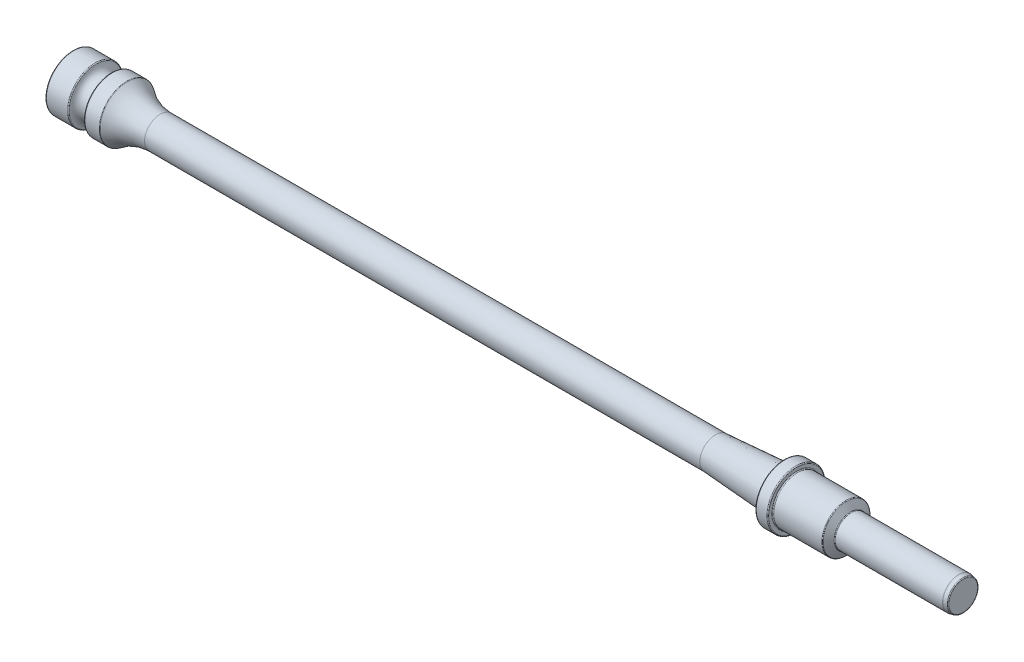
ISO-10303-21;
HEADER;
FILE_DESCRIPTION(('STEP AP214'),'2;1');
FILE_NAME('part.step','',(''),(''),'','','');
FILE_SCHEMA(('AUTOMOTIVE_DESIGN { 1 0 10303 214 1 1 1 1 }'));
ENDSEC;
DATA;
#1=APPLICATION_CONTEXT('core data for automotive mechanical design processes');
#2=APPLICATION_PROTOCOL_DEFINITION('international standard','automotive_design',2000,#1);
#3=PRODUCT_CONTEXT('',#1,'mechanical');
#4=PRODUCT('Part','Part','',(#3));
#5=PRODUCT_RELATED_PRODUCT_CATEGORY('part','',(#4));
#6=PRODUCT_DEFINITION_FORMATION('','',#4);
#7=PRODUCT_DEFINITION_CONTEXT('part definition',#1,'design');
#8=PRODUCT_DEFINITION('design','',#6,#7);
#9=PRODUCT_DEFINITION_SHAPE('','',#8);
#10=(LENGTH_UNIT() NAMED_UNIT(*) SI_UNIT(.MILLI.,.METRE.));
#11=(NAMED_UNIT(*) PLANE_ANGLE_UNIT() SI_UNIT($,.RADIAN.));
#12=(NAMED_UNIT(*) SI_UNIT($,.STERADIAN.) SOLID_ANGLE_UNIT());
#13=UNCERTAINTY_MEASURE_WITH_UNIT(LENGTH_MEASURE(1.E-05),#10,'distance_accuracy_value','');
#14=(GEOMETRIC_REPRESENTATION_CONTEXT(3) GLOBAL_UNCERTAINTY_ASSIGNED_CONTEXT((#13)) GLOBAL_UNIT_ASSIGNED_CONTEXT((#10,
#11,#12)) REPRESENTATION_CONTEXT('',''));
#15=CARTESIAN_POINT('',(0.,0.,0.));
#16=DIRECTION('',(0.,0.,1.));
#17=DIRECTION('',(1.,0.,0.));
#18=AXIS2_PLACEMENT_3D('',#15,#16,#17);
#19=CARTESIAN_POINT('',(0.,0.,0.));
#20=DIRECTION('',(1.,0.,0.));
#21=DIRECTION('',(0.,0.,-1.));
#22=AXIS2_PLACEMENT_3D('',#19,#20,#21);
#23=PLANE('',#22);
#24=CARTESIAN_POINT('',(0.,0.,0.));
#25=DIRECTION('',(-1.,0.,0.));
#26=DIRECTION('',(0.,0.,1.));
#27=AXIS2_PLACEMENT_3D('',#24,#25,#26);
#28=CIRCLE('',#27,5.8);
#29=CARTESIAN_POINT('',(0.,0.,5.8));
#30=VERTEX_POINT('',#29);
#31=EDGE_CURVE('E10',#30,#30,#28,.T.);
#32=ORIENTED_EDGE('',*,*,#31,.T.);
#33=EDGE_LOOP('',(#32));
#34=FACE_BOUND('',#33,.T.);
#35=ADVANCED_FACE('F29',(#34),#23,.F.);
#36=CARTESIAN_POINT('',(0.2,0.,0.));
#37=DIRECTION('',(-1.,0.,0.));
#38=DIRECTION('',(0.,0.,1.));
#39=AXIS2_PLACEMENT_3D('',#36,#37,#38);
#40=TOROIDAL_SURFACE('',#39,5.8,0.2);
#41=ORIENTED_EDGE('',*,*,#31,.F.);
#42=EDGE_LOOP('',(#41));
#43=FACE_BOUND('',#42,.T.);
#44=CARTESIAN_POINT('',(0.200000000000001,0.,0.));
#45=DIRECTION('',(-1.,0.,0.));
#46=DIRECTION('',(0.,0.,1.));
#47=AXIS2_PLACEMENT_3D('',#44,#45,#46);
#48=CIRCLE('',#47,6.);
#49=CARTESIAN_POINT('',(0.200000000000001,0.,6.));
#50=VERTEX_POINT('',#49);
#51=EDGE_CURVE('E35',#50,#50,#48,.T.);
#52=ORIENTED_EDGE('',*,*,#51,.T.);
#53=EDGE_LOOP('',(#52));
#54=FACE_BOUND('',#53,.T.);
#55=ADVANCED_FACE('F130',(#43,#54),#40,.T.);
#56=CARTESIAN_POINT('',(0.,0.,0.));
#57=DIRECTION('',(-1.,0.,0.));
#58=DIRECTION('',(0.,0.,1.));
#59=AXIS2_PLACEMENT_3D('',#56,#57,#58);
#60=CYLINDRICAL_SURFACE('',#59,6.);
#61=ORIENTED_EDGE('',*,*,#51,.F.);
#62=EDGE_LOOP('',(#61));
#63=FACE_BOUND('',#62,.T.);
#64=CARTESIAN_POINT('',(4.81055563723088,0.,0.));
#65=DIRECTION('',(-1.,0.,0.));
#66=DIRECTION('',(0.,0.,1.));
#67=AXIS2_PLACEMENT_3D('',#64,#65,#66);
#68=CIRCLE('',#67,6.);
#69=CARTESIAN_POINT('',(4.81055563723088,0.,6.));
#70=VERTEX_POINT('',#69);
#71=EDGE_CURVE('E39',#70,#70,#68,.T.);
#72=ORIENTED_EDGE('',*,*,#71,.T.);
#73=EDGE_LOOP('',(#72));
#74=FACE_BOUND('',#73,.T.);
#75=ADVANCED_FACE('F134',(#63,#74),#60,.T.);
#76=CARTESIAN_POINT('',(4.81055563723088,0.,0.));
#77=DIRECTION('',(-1.,0.,0.));
#78=DIRECTION('',(0.,0.,1.));
#79=AXIS2_PLACEMENT_3D('',#76,#77,#78);
#80=TOROIDAL_SURFACE('',#79,5.8,0.2);
#81=ORIENTED_EDGE('',*,*,#71,.F.);
#82=EDGE_LOOP('',(#81));
#83=FACE_BOUND('',#82,.T.);
#84=CARTESIAN_POINT('',(5.00944451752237,0.,0.));
#85=DIRECTION('',(-1.,0.,0.));
#86=DIRECTION('',(0.,0.,1.));
#87=AXIS2_PLACEMENT_3D('',#84,#85,#86);
#88=CIRCLE('',#87,5.82105263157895);
#89=CARTESIAN_POINT('',(5.00944451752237,0.,5.82105263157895));
#90=VERTEX_POINT('',#89);
#91=EDGE_CURVE('E43',#90,#90,#88,.T.);
#92=ORIENTED_EDGE('',*,*,#91,.T.);
#93=EDGE_LOOP('',(#92));
#94=FACE_BOUND('',#93,.T.);
#95=ADVANCED_FACE('F139',(#83,#94),#80,.T.);
#96=CARTESIAN_POINT('',(6.7,0.,0.));
#97=DIRECTION('',(-1.,0.,0.));
#98=DIRECTION('',(0.,0.,1.));
#99=AXIS2_PLACEMENT_3D('',#96,#97,#98);
#100=TOROIDAL_SURFACE('',#99,5.99999999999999,1.7);
#101=ORIENTED_EDGE('',*,*,#91,.F.);
#102=EDGE_LOOP('',(#101));
#103=FACE_BOUND('',#102,.T.);
#104=CARTESIAN_POINT('',(8.39055548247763,0.,0.));
#105=DIRECTION('',(-1.,0.,0.));
#106=DIRECTION('',(0.,0.,1.));
#107=AXIS2_PLACEMENT_3D('',#104,#105,#106);
#108=CIRCLE('',#107,5.82105263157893);
#109=CARTESIAN_POINT('',(8.39055548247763,0.,5.82105263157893));
#110=VERTEX_POINT('',#109);
#111=EDGE_CURVE('E48',#110,#110,#108,.T.);
#112=ORIENTED_EDGE('',*,*,#111,.T.);
#113=EDGE_LOOP('',(#112));
#114=FACE_BOUND('',#113,.T.);
#115=ADVANCED_FACE('F145',(#103,#114),#100,.F.);
#116=CARTESIAN_POINT('',(8.58944436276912,0.,0.));
#117=DIRECTION('',(-1.,0.,0.));
#118=DIRECTION('',(0.,0.,1.));
#119=AXIS2_PLACEMENT_3D('',#116,#117,#118);
#120=TOROIDAL_SURFACE('',#119,5.79999999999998,0.2);
#121=ORIENTED_EDGE('',*,*,#111,.F.);
#122=EDGE_LOOP('',(#121));
#123=FACE_BOUND('',#122,.T.);
#124=CARTESIAN_POINT('',(8.58944436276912,0.,0.));
#125=DIRECTION('',(-1.,0.,0.));
#126=DIRECTION('',(0.,0.,1.));
#127=AXIS2_PLACEMENT_3D('',#124,#125,#126);
#128=CIRCLE('',#127,5.99999999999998);
#129=CARTESIAN_POINT('',(8.58944436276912,0.,5.99999999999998));
#130=VERTEX_POINT('',#129);
#131=EDGE_CURVE('E51',#130,#130,#128,.T.);
#132=ORIENTED_EDGE('',*,*,#131,.T.);
#133=EDGE_LOOP('',(#132));
#134=FACE_BOUND('',#133,.T.);
#135=ADVANCED_FACE('F149',(#123,#134),#120,.T.);
#136=CARTESIAN_POINT('',(0.,0.,0.));
#137=DIRECTION('',(-1.,0.,0.));
#138=DIRECTION('',(0.,0.,1.));
#139=AXIS2_PLACEMENT_3D('',#136,#137,#138);
#140=CYLINDRICAL_SURFACE('',#139,5.99999999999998);
#141=ORIENTED_EDGE('',*,*,#131,.F.);
#142=EDGE_LOOP('',(#141));
#143=FACE_BOUND('',#142,.T.);
#144=CARTESIAN_POINT('',(11.7281364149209,0.,0.));
#145=DIRECTION('',(-1.,0.,0.));
#146=DIRECTION('',(0.,0.,1.));
#147=AXIS2_PLACEMENT_3D('',#144,#145,#146);
#148=CIRCLE('',#147,5.99999999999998);
#149=CARTESIAN_POINT('',(11.7281364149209,0.,5.99999999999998));
#150=VERTEX_POINT('',#149);
#151=EDGE_CURVE('E54',#150,#150,#148,.T.);
#152=ORIENTED_EDGE('',*,*,#151,.T.);
#153=EDGE_LOOP('',(#152));
#154=FACE_BOUND('',#153,.T.);
#155=ADVANCED_FACE('F153',(#143,#154),#140,.T.);
#156=CARTESIAN_POINT('',(11.7281364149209,0.,0.));
#157=DIRECTION('',(-1.,0.,0.));
#158=DIRECTION('',(0.,0.,1.));
#159=AXIS2_PLACEMENT_3D('',#156,#157,#158);
#160=TOROIDAL_SURFACE('',#159,5.79999999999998,0.200000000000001);
#161=ORIENTED_EDGE('',*,*,#151,.F.);
#162=EDGE_LOOP('',(#161));
#163=FACE_BOUND('',#162,.T.);
#164=CARTESIAN_POINT('',(11.8549428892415,0.,0.));
#165=DIRECTION('',(-1.,0.,0.));
#166=DIRECTION('',(0.,0.,1.));
#167=AXIS2_PLACEMENT_3D('',#164,#165,#166);
#168=CIRCLE('',#167,5.95466130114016);
#169=CARTESIAN_POINT('',(11.8549428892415,0.,5.95466130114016));
#170=VERTEX_POINT('',#169);
#171=EDGE_CURVE('E57',#170,#170,#168,.T.);
#172=ORIENTED_EDGE('',*,*,#171,.T.);
#173=EDGE_LOOP('',(#172));
#174=FACE_BOUND('',#173,.T.);
#175=ADVANCED_FACE('F157',(#163,#174),#160,.T.);
#176=CARTESIAN_POINT('',(19.,0.,0.));
#177=DIRECTION('',(-1.,0.,0.));
#178=DIRECTION('',(0.,0.,1.));
#179=AXIS2_PLACEMENT_3D('',#176,#177,#178);
#180=TOROIDAL_SURFACE('',#179,14.6692307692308,11.2692307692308);
#181=ORIENTED_EDGE('',*,*,#171,.F.);
#182=EDGE_LOOP('',(#181));
#183=FACE_BOUND('',#182,.T.);
#184=CARTESIAN_POINT('',(19.,0.,0.));
#185=DIRECTION('',(-1.,0.,0.));
#186=DIRECTION('',(0.,0.,1.));
#187=AXIS2_PLACEMENT_3D('',#184,#185,#186);
#188=CIRCLE('',#187,3.4);
#189=CARTESIAN_POINT('',(19.,0.,3.4));
#190=VERTEX_POINT('',#189);
#191=EDGE_CURVE('E60',#190,#190,#188,.T.);
#192=ORIENTED_EDGE('',*,*,#191,.T.);
#193=EDGE_LOOP('',(#192));
#194=FACE_BOUND('',#193,.T.);
#195=ADVANCED_FACE('F161',(#183,#194),#180,.F.);
#196=CARTESIAN_POINT('',(0.,0.,0.));
#197=DIRECTION('',(-1.,0.,0.));
#198=DIRECTION('',(0.,0.,1.));
#199=AXIS2_PLACEMENT_3D('',#196,#197,#198);
#200=CYLINDRICAL_SURFACE('',#199,3.4);
#201=ORIENTED_EDGE('',*,*,#191,.F.);
#202=EDGE_LOOP('',(#201));
#203=FACE_BOUND('',#202,.T.);
#204=CARTESIAN_POINT('',(139.993340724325,0.,0.));
#205=DIRECTION('',(-1.,0.,0.));
#206=DIRECTION('',(0.,0.,1.));
#207=AXIS2_PLACEMENT_3D('',#204,#205,#206);
#208=CIRCLE('',#207,3.4);
#209=CARTESIAN_POINT('',(139.993340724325,0.,3.4));
#210=VERTEX_POINT('',#209);
#211=EDGE_CURVE('E63',#210,#210,#208,.T.);
#212=ORIENTED_EDGE('',*,*,#211,.T.);
#213=EDGE_LOOP('',(#212));
#214=FACE_BOUND('',#213,.T.);
#215=ADVANCED_FACE('F165',(#203,#214),#200,.T.);
#216=CARTESIAN_POINT('',(139.993340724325,0.,0.));
#217=DIRECTION('',(-1.,0.,0.));
#218=DIRECTION('',(0.,0.,1.));
#219=AXIS2_PLACEMENT_3D('',#216,#217,#218);
#220=TOROIDAL_SURFACE('',#219,3.6,0.2);
#221=ORIENTED_EDGE('',*,*,#211,.F.);
#222=EDGE_LOOP('',(#221));
#223=FACE_BOUND('',#222,.T.);
#224=CARTESIAN_POINT('',(140.00664452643,0.,0.));
#225=DIRECTION('',(-1.,0.,0.));
#226=DIRECTION('',(0.,0.,1.));
#227=AXIS2_PLACEMENT_3D('',#224,#225,#226);
#228=CIRCLE('',#227,3.40044296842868);
#229=CARTESIAN_POINT('',(140.00664452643,0.,3.40044296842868));
#230=VERTEX_POINT('',#229);
#231=EDGE_CURVE('E66',#230,#230,#228,.T.);
#232=ORIENTED_EDGE('',*,*,#231,.T.);
#233=EDGE_LOOP('',(#232));
#234=FACE_BOUND('',#233,.T.);
#235=ADVANCED_FACE('F169',(#223,#234),#220,.F.);
#236=CARTESIAN_POINT('',(154.813303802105,0.,0.));
#237=DIRECTION('',(1.,0.,0.));
#238=DIRECTION('',(0.,0.,-1.));
#239=AXIS2_PLACEMENT_3D('',#236,#237,#238);
#240=CONICAL_SURFACE('',#239,4.38755358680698,0.0665681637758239);
#241=ORIENTED_EDGE('',*,*,#231,.F.);
#242=EDGE_LOOP('',(#241));
#243=FACE_BOUND('',#242,.T.);
#244=CARTESIAN_POINT('',(154.813303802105,0.,0.));
#245=DIRECTION('',(-1.,0.,0.));
#246=DIRECTION('',(0.,0.,1.));
#247=AXIS2_PLACEMENT_3D('',#244,#245,#246);
#248=CIRCLE('',#247,4.38755358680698);
#249=CARTESIAN_POINT('',(154.813303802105,0.,4.38755358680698));
#250=VERTEX_POINT('',#249);
#251=EDGE_CURVE('E69',#250,#250,#248,.T.);
#252=ORIENTED_EDGE('',*,*,#251,.T.);
#253=EDGE_LOOP('',(#252));
#254=FACE_BOUND('',#253,.T.);
#255=ADVANCED_FACE('F173',(#243,#254),#240,.T.);
#256=CARTESIAN_POINT('',(154.8,0.,0.));
#257=DIRECTION('',(-1.,0.,0.));
#258=DIRECTION('',(0.,0.,1.));
#259=AXIS2_PLACEMENT_3D('',#256,#257,#258);
#260=TOROIDAL_SURFACE('',#259,4.58711061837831,0.200000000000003);
#261=ORIENTED_EDGE('',*,*,#251,.F.);
#262=EDGE_LOOP('',(#261));
#263=FACE_BOUND('',#262,.T.);
#264=CARTESIAN_POINT('',(155.,0.,0.));
#265=DIRECTION('',(-1.,0.,0.));
#266=DIRECTION('',(0.,0.,1.));
#267=AXIS2_PLACEMENT_3D('',#264,#265,#266);
#268=CIRCLE('',#267,4.58711061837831);
#269=CARTESIAN_POINT('',(155.,0.,4.58711061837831));
#270=VERTEX_POINT('',#269);
#271=EDGE_CURVE('E72',#270,#270,#268,.T.);
#272=ORIENTED_EDGE('',*,*,#271,.T.);
#273=EDGE_LOOP('',(#272));
#274=FACE_BOUND('',#273,.T.);
#275=ADVANCED_FACE('F177',(#263,#274),#260,.F.);
#276=CARTESIAN_POINT('',(155.,4.58711061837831,0.));
#277=DIRECTION('',(1.,0.,0.));
#278=DIRECTION('',(0.,0.,-1.));
#279=AXIS2_PLACEMENT_3D('',#276,#277,#278);
#280=PLANE('',#279);
#281=ORIENTED_EDGE('',*,*,#271,.F.);
#282=EDGE_LOOP('',(#281));
#283=FACE_BOUND('',#282,.T.);
#284=CARTESIAN_POINT('',(155.,0.,0.));
#285=DIRECTION('',(-1.,0.,0.));
#286=DIRECTION('',(0.,0.,1.));
#287=AXIS2_PLACEMENT_3D('',#284,#285,#286);
#288=CIRCLE('',#287,6.1);
#289=CARTESIAN_POINT('',(155.,0.,6.1));
#290=VERTEX_POINT('',#289);
#291=EDGE_CURVE('E75',#290,#290,#288,.T.);
#292=ORIENTED_EDGE('',*,*,#291,.T.);
#293=EDGE_LOOP('',(#292));
#294=FACE_BOUND('',#293,.T.);
#295=ADVANCED_FACE('F181',(#283,#294),#280,.F.);
#296=CARTESIAN_POINT('',(155.2,0.,0.));
#297=DIRECTION('',(-1.,0.,0.));
#298=DIRECTION('',(0.,0.,1.));
#299=AXIS2_PLACEMENT_3D('',#296,#297,#298);
#300=TOROIDAL_SURFACE('',#299,6.1,0.200000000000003);
#301=ORIENTED_EDGE('',*,*,#291,.F.);
#302=EDGE_LOOP('',(#301));
#303=FACE_BOUND('',#302,.T.);
#304=CARTESIAN_POINT('',(155.2,0.,0.));
#305=DIRECTION('',(-1.,0.,0.));
#306=DIRECTION('',(0.,0.,1.));
#307=AXIS2_PLACEMENT_3D('',#304,#305,#306);
#308=CIRCLE('',#307,6.3);
#309=CARTESIAN_POINT('',(155.2,0.,6.3));
#310=VERTEX_POINT('',#309);
#311=EDGE_CURVE('E78',#310,#310,#308,.T.);
#312=ORIENTED_EDGE('',*,*,#311,.T.);
#313=EDGE_LOOP('',(#312));
#314=FACE_BOUND('',#313,.T.);
#315=ADVANCED_FACE('F185',(#303,#314),#300,.T.);
#316=CARTESIAN_POINT('',(0.,0.,0.));
#317=DIRECTION('',(-1.,0.,0.));
#318=DIRECTION('',(0.,0.,1.));
#319=AXIS2_PLACEMENT_3D('',#316,#317,#318);
#320=CYLINDRICAL_SURFACE('',#319,6.3);
#321=ORIENTED_EDGE('',*,*,#311,.F.);
#322=EDGE_LOOP('',(#321));
#323=FACE_BOUND('',#322,.T.);
#324=CARTESIAN_POINT('',(157.5,0.,0.));
#325=DIRECTION('',(-1.,0.,0.));
#326=DIRECTION('',(0.,0.,1.));
#327=AXIS2_PLACEMENT_3D('',#324,#325,#326);
#328=CIRCLE('',#327,6.3);
#329=CARTESIAN_POINT('',(157.5,0.,6.3));
#330=VERTEX_POINT('',#329);
#331=EDGE_CURVE('E81',#330,#330,#328,.T.);
#332=ORIENTED_EDGE('',*,*,#331,.T.);
#333=EDGE_LOOP('',(#332));
#334=FACE_BOUND('',#333,.T.);
#335=ADVANCED_FACE('F189',(#323,#334),#320,.T.);
#336=CARTESIAN_POINT('',(157.5,0.,0.));
#337=DIRECTION('',(-1.,0.,0.));
#338=DIRECTION('',(0.,0.,1.));
#339=AXIS2_PLACEMENT_3D('',#336,#337,#338);
#340=TOROIDAL_SURFACE('',#339,6.1,0.200000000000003);
#341=ORIENTED_EDGE('',*,*,#331,.F.);
#342=EDGE_LOOP('',(#341));
#343=FACE_BOUND('',#342,.T.);
#344=CARTESIAN_POINT('',(157.7,0.,0.));
#345=DIRECTION('',(-1.,0.,0.));
#346=DIRECTION('',(0.,0.,1.));
#347=AXIS2_PLACEMENT_3D('',#344,#345,#346);
#348=CIRCLE('',#347,6.1);
#349=CARTESIAN_POINT('',(157.7,0.,6.1));
#350=VERTEX_POINT('',#349);
#351=EDGE_CURVE('E84',#350,#350,#348,.T.);
#352=ORIENTED_EDGE('',*,*,#351,.T.);
#353=EDGE_LOOP('',(#352));
#354=FACE_BOUND('',#353,.T.);
#355=ADVANCED_FACE('F193',(#343,#354),#340,.T.);
#356=CARTESIAN_POINT('',(157.7,5.4,0.));
#357=DIRECTION('',(-1.,0.,0.));
#358=DIRECTION('',(0.,0.,1.));
#359=AXIS2_PLACEMENT_3D('',#356,#357,#358);
#360=PLANE('',#359);
#361=ORIENTED_EDGE('',*,*,#351,.F.);
#362=EDGE_LOOP('',(#361));
#363=FACE_BOUND('',#362,.T.);
#364=CARTESIAN_POINT('',(157.7,0.,0.));
#365=DIRECTION('',(-1.,0.,0.));
#366=DIRECTION('',(0.,0.,1.));
#367=AXIS2_PLACEMENT_3D('',#364,#365,#366);
#368=CIRCLE('',#367,5.4);
#369=CARTESIAN_POINT('',(157.7,0.,5.4));
#370=VERTEX_POINT('',#369);
#371=EDGE_CURVE('E87',#370,#370,#368,.T.);
#372=ORIENTED_EDGE('',*,*,#371,.T.);
#373=EDGE_LOOP('',(#372));
#374=FACE_BOUND('',#373,.T.);
#375=ADVANCED_FACE('F197',(#363,#374),#360,.F.);
#376=CARTESIAN_POINT('',(157.9,0.,0.));
#377=DIRECTION('',(-1.,0.,0.));
#378=DIRECTION('',(0.,0.,1.));
#379=AXIS2_PLACEMENT_3D('',#376,#377,#378);
#380=TOROIDAL_SURFACE('',#379,5.4,0.200000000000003);
#381=ORIENTED_EDGE('',*,*,#371,.F.);
#382=EDGE_LOOP('',(#381));
#383=FACE_BOUND('',#382,.T.);
#384=CARTESIAN_POINT('',(157.9,0.,0.));
#385=DIRECTION('',(-1.,0.,0.));
#386=DIRECTION('',(0.,0.,1.));
#387=AXIS2_PLACEMENT_3D('',#384,#385,#386);
#388=CIRCLE('',#387,5.19999999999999);
#389=CARTESIAN_POINT('',(157.9,0.,5.19999999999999));
#390=VERTEX_POINT('',#389);
#391=EDGE_CURVE('E90',#390,#390,#388,.T.);
#392=ORIENTED_EDGE('',*,*,#391,.T.);
#393=EDGE_LOOP('',(#392));
#394=FACE_BOUND('',#393,.T.);
#395=ADVANCED_FACE('F201',(#383,#394),#380,.F.);
#396=CARTESIAN_POINT('',(0.,0.,0.));
#397=DIRECTION('',(-1.,0.,0.));
#398=DIRECTION('',(0.,0.,1.));
#399=AXIS2_PLACEMENT_3D('',#396,#397,#398);
#400=CYLINDRICAL_SURFACE('',#399,5.2);
#401=ORIENTED_EDGE('',*,*,#391,.F.);
#402=EDGE_LOOP('',(#401));
#403=FACE_BOUND('',#402,.T.);
#404=CARTESIAN_POINT('',(168.385610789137,0.,0.));
#405=DIRECTION('',(-1.,0.,0.));
#406=DIRECTION('',(0.,0.,1.));
#407=AXIS2_PLACEMENT_3D('',#404,#405,#406);
#408=CIRCLE('',#407,5.2);
#409=CARTESIAN_POINT('',(168.385610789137,0.,5.2));
#410=VERTEX_POINT('',#409);
#411=EDGE_CURVE('E93',#410,#410,#408,.T.);
#412=ORIENTED_EDGE('',*,*,#411,.T.);
#413=EDGE_LOOP('',(#412));
#414=FACE_BOUND('',#413,.T.);
#415=ADVANCED_FACE('F205',(#403,#414),#400,.T.);
#416=CARTESIAN_POINT('',(168.385610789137,0.,0.));
#417=DIRECTION('',(-1.,0.,0.));
#418=DIRECTION('',(0.,0.,1.));
#419=AXIS2_PLACEMENT_3D('',#416,#417,#418);
#420=TOROIDAL_SURFACE('',#419,5.,0.200000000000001);
#421=ORIENTED_EDGE('',*,*,#411,.F.);
#422=EDGE_LOOP('',(#421));
#423=FACE_BOUND('',#422,.T.);
#424=CARTESIAN_POINT('',(168.557997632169,0.,0.));
#425=DIRECTION('',(-1.,0.,0.));
#426=DIRECTION('',(0.,0.,1.));
#427=AXIS2_PLACEMENT_3D('',#424,#425,#426);
#428=CIRCLE('',#427,5.10140402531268);
#429=CARTESIAN_POINT('',(168.557997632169,0.,5.10140402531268));
#430=VERTEX_POINT('',#429);
#431=EDGE_CURVE('E96',#430,#430,#428,.T.);
#432=ORIENTED_EDGE('',*,*,#431,.T.);
#433=EDGE_LOOP('',(#432));
#434=FACE_BOUND('',#433,.T.);
#435=ADVANCED_FACE('F209',(#423,#434),#420,.T.);
#436=CARTESIAN_POINT('',(169.442002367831,0.,0.));
#437=DIRECTION('',(-1.,0.,0.));
#438=DIRECTION('',(0.,0.,1.));
#439=AXIS2_PLACEMENT_3D('',#436,#437,#438);
#440=CONICAL_SURFACE('',#439,3.59859597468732,1.03907225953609);
#441=ORIENTED_EDGE('',*,*,#431,.F.);
#442=EDGE_LOOP('',(#441));
#443=FACE_BOUND('',#442,.T.);
#444=CARTESIAN_POINT('',(169.442002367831,0.,0.));
#445=DIRECTION('',(-1.,0.,0.));
#446=DIRECTION('',(0.,0.,1.));
#447=AXIS2_PLACEMENT_3D('',#444,#445,#446);
#448=CIRCLE('',#447,3.59859597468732);
#449=CARTESIAN_POINT('',(169.442002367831,0.,3.59859597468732));
#450=VERTEX_POINT('',#449);
#451=EDGE_CURVE('E99',#450,#450,#448,.T.);
#452=ORIENTED_EDGE('',*,*,#451,.T.);
#453=EDGE_LOOP('',(#452));
#454=FACE_BOUND('',#453,.T.);
#455=ADVANCED_FACE('F213',(#443,#454),#440,.T.);
#456=CARTESIAN_POINT('',(169.614389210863,0.,0.));
#457=DIRECTION('',(-1.,0.,0.));
#458=DIRECTION('',(0.,0.,1.));
#459=AXIS2_PLACEMENT_3D('',#456,#457,#458);
#460=TOROIDAL_SURFACE('',#459,3.7,0.200000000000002);
#461=ORIENTED_EDGE('',*,*,#451,.F.);
#462=EDGE_LOOP('',(#461));
#463=FACE_BOUND('',#462,.T.);
#464=CARTESIAN_POINT('',(169.614389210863,0.,0.));
#465=DIRECTION('',(-1.,0.,0.));
#466=DIRECTION('',(0.,0.,1.));
#467=AXIS2_PLACEMENT_3D('',#464,#465,#466);
#468=CIRCLE('',#467,3.5);
#469=CARTESIAN_POINT('',(169.614389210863,0.,3.5));
#470=VERTEX_POINT('',#469);
#471=EDGE_CURVE('E102',#470,#470,#468,.T.);
#472=ORIENTED_EDGE('',*,*,#471,.T.);
#473=EDGE_LOOP('',(#472));
#474=FACE_BOUND('',#473,.T.);
#475=ADVANCED_FACE('F217',(#463,#474),#460,.F.);
#476=CARTESIAN_POINT('',(0.,0.,0.));
#477=DIRECTION('',(-1.,0.,0.));
#478=DIRECTION('',(0.,0.,1.));
#479=AXIS2_PLACEMENT_3D('',#476,#477,#478);
#480=CYLINDRICAL_SURFACE('',#479,3.5);
#481=ORIENTED_EDGE('',*,*,#471,.F.);
#482=EDGE_LOOP('',(#481));
#483=FACE_BOUND('',#482,.T.);
#484=CARTESIAN_POINT('',(192.980196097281,0.,0.));
#485=DIRECTION('',(-1.,0.,0.));
#486=DIRECTION('',(0.,0.,1.));
#487=AXIS2_PLACEMENT_3D('',#484,#485,#486);
#488=CIRCLE('',#487,3.5);
#489=CARTESIAN_POINT('',(192.980196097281,0.,3.5));
#490=VERTEX_POINT('',#489);
#491=EDGE_CURVE('E105',#490,#490,#488,.T.);
#492=ORIENTED_EDGE('',*,*,#491,.T.);
#493=EDGE_LOOP('',(#492));
#494=FACE_BOUND('',#493,.T.);
#495=ADVANCED_FACE('F221',(#483,#494),#480,.T.);
#496=CARTESIAN_POINT('',(192.980196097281,0.,0.));
#497=DIRECTION('',(-1.,0.,0.));
#498=DIRECTION('',(0.,0.,1.));
#499=AXIS2_PLACEMENT_3D('',#496,#497,#498);
#500=TOROIDAL_SURFACE('',#499,3.3,0.199999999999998);
#501=ORIENTED_EDGE('',*,*,#491,.F.);
#502=EDGE_LOOP('',(#501));
#503=FACE_BOUND('',#502,.T.);
#504=CARTESIAN_POINT('',(193.019419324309,0.,0.));
#505=DIRECTION('',(-1.,0.,0.));
#506=DIRECTION('',(0.,0.,1.));
#507=AXIS2_PLACEMENT_3D('',#504,#505,#506);
#508=CIRCLE('',#507,3.49611613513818);
#509=CARTESIAN_POINT('',(193.019419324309,0.,3.49611613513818));
#510=VERTEX_POINT('',#509);
#511=EDGE_CURVE('E108',#510,#510,#508,.T.);
#512=ORIENTED_EDGE('',*,*,#511,.T.);
#513=EDGE_LOOP('',(#512));
#514=FACE_BOUND('',#513,.T.);
#515=ADVANCED_FACE('F225',(#503,#514),#500,.T.);
#516=CARTESIAN_POINT('',(193.839223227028,0.,0.));
#517=DIRECTION('',(-1.,0.,0.));
#518=DIRECTION('',(0.,0.,1.));
#519=AXIS2_PLACEMENT_3D('',#516,#517,#518);
#520=CONICAL_SURFACE('',#519,3.33215535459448,0.197395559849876);
#521=ORIENTED_EDGE('',*,*,#511,.F.);
#522=EDGE_LOOP('',(#521));
#523=FACE_BOUND('',#522,.T.);
#524=CARTESIAN_POINT('',(193.839223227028,0.,0.));
#525=DIRECTION('',(-1.,0.,0.));
#526=DIRECTION('',(0.,0.,1.));
#527=AXIS2_PLACEMENT_3D('',#524,#525,#526);
#528=CIRCLE('',#527,3.33215535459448);
#529=CARTESIAN_POINT('',(193.839223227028,0.,3.33215535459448));
#530=VERTEX_POINT('',#529);
#531=EDGE_CURVE('E111',#530,#530,#528,.T.);
#532=ORIENTED_EDGE('',*,*,#531,.T.);
#533=EDGE_LOOP('',(#532));
#534=FACE_BOUND('',#533,.T.);
#535=ADVANCED_FACE('F126',(#523,#534),#520,.T.);
#536=CARTESIAN_POINT('',(193.8,0.,0.));
#537=DIRECTION('',(-1.,0.,0.));
#538=DIRECTION('',(0.,0.,1.));
#539=AXIS2_PLACEMENT_3D('',#536,#537,#538);
#540=TOROIDAL_SURFACE('',#539,3.13603921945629,0.200000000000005);
#541=ORIENTED_EDGE('',*,*,#531,.F.);
#542=EDGE_LOOP('',(#541));
#543=FACE_BOUND('',#542,.T.);
#544=CARTESIAN_POINT('',(194.,0.,0.));
#545=DIRECTION('',(-1.,0.,0.));
#546=DIRECTION('',(0.,0.,1.));
#547=AXIS2_PLACEMENT_3D('',#544,#545,#546);
#548=CIRCLE('',#547,3.13603921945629);
#549=CARTESIAN_POINT('',(194.,0.,3.13603921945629));
#550=VERTEX_POINT('',#549);
#551=EDGE_CURVE('E114',#550,#550,#548,.T.);
#552=ORIENTED_EDGE('',*,*,#551,.T.);
#553=EDGE_LOOP('',(#552));
#554=FACE_BOUND('',#553,.T.);
#555=ADVANCED_FACE('F118',(#543,#554),#540,.T.);
#556=CARTESIAN_POINT('',(194.,0.,0.));
#557=DIRECTION('',(-1.,0.,0.));
#558=DIRECTION('',(0.,0.,1.));
#559=AXIS2_PLACEMENT_3D('',#556,#557,#558);
#560=PLANE('',#559);
#561=ORIENTED_EDGE('',*,*,#551,.F.);
#562=EDGE_LOOP('',(#561));
#563=FACE_BOUND('',#562,.T.);
#564=ADVANCED_FACE('F120',(#563),#560,.F.);
#565=CLOSED_SHELL('',(#35,#55,#75,#95,#115,#135,#155,#175,#195,#215,#235,#255,#275,#295,#315,
#335,#355,#375,#395,#415,#435,#455,#475,#495,#515,#535,#555,#564));
#566=MANIFOLD_SOLID_BREP('B2',#565);
#567=ADVANCED_BREP_SHAPE_REPRESENTATION('',(#18,#566),#14);
#568=SHAPE_DEFINITION_REPRESENTATION(#9,#567);
ENDSEC;
END-ISO-10303-21;
